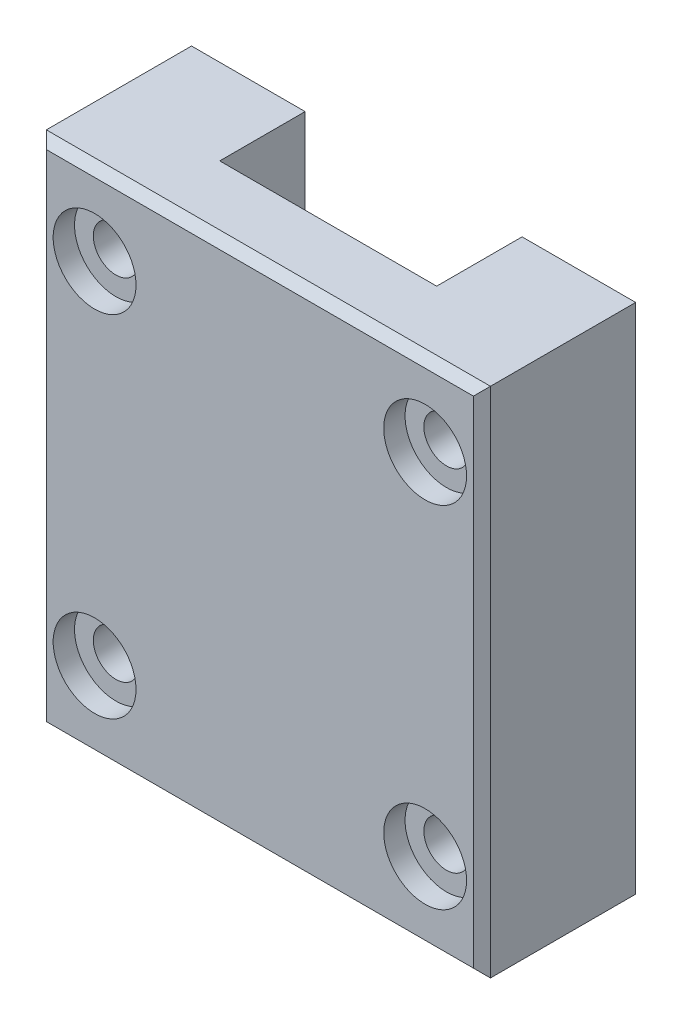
ISO-10303-21;
HEADER;
FILE_DESCRIPTION(('STEP AP214'),'2;1');
FILE_NAME('part.step','',(''),(''),'','','');
FILE_SCHEMA(('AUTOMOTIVE_DESIGN { 1 0 10303 214 1 1 1 1 }'));
ENDSEC;
DATA;
#1=APPLICATION_CONTEXT('core data for automotive mechanical design processes');
#2=APPLICATION_PROTOCOL_DEFINITION('international standard','automotive_design',2000,#1);
#3=PRODUCT_CONTEXT('',#1,'mechanical');
#4=PRODUCT('Part','Part','',(#3));
#5=PRODUCT_RELATED_PRODUCT_CATEGORY('part','',(#4));
#6=PRODUCT_DEFINITION_FORMATION('','',#4);
#7=PRODUCT_DEFINITION_CONTEXT('part definition',#1,'design');
#8=PRODUCT_DEFINITION('design','',#6,#7);
#9=PRODUCT_DEFINITION_SHAPE('','',#8);
#10=(LENGTH_UNIT() NAMED_UNIT(*) SI_UNIT(.MILLI.,.METRE.));
#11=(NAMED_UNIT(*) PLANE_ANGLE_UNIT() SI_UNIT($,.RADIAN.));
#12=(NAMED_UNIT(*) SI_UNIT($,.STERADIAN.) SOLID_ANGLE_UNIT());
#13=UNCERTAINTY_MEASURE_WITH_UNIT(LENGTH_MEASURE(1.E-05),#10,'distance_accuracy_value','');
#14=(GEOMETRIC_REPRESENTATION_CONTEXT(3) GLOBAL_UNCERTAINTY_ASSIGNED_CONTEXT((#13)) GLOBAL_UNIT_ASSIGNED_CONTEXT((#10,
#11,#12)) REPRESENTATION_CONTEXT('',''));
#15=CARTESIAN_POINT('',(0.,0.,0.));
#16=DIRECTION('',(0.,0.,1.));
#17=DIRECTION('',(1.,0.,0.));
#18=AXIS2_PLACEMENT_3D('',#15,#16,#17);
#19=CARTESIAN_POINT('',(-9.95000000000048,99.4999999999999,-10.));
#20=DIRECTION('',(0.,0.,1.));
#21=DIRECTION('',(1.,0.,0.));
#22=AXIS2_PLACEMENT_3D('',#19,#20,#21);
#23=CYLINDRICAL_SURFACE('',#22,2.65);
#24=CARTESIAN_POINT('',(-9.95000000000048,99.4999999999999,-10.));
#25=DIRECTION('',(0.,0.,1.));
#26=DIRECTION('',(1.,0.,0.));
#27=AXIS2_PLACEMENT_3D('',#24,#25,#26);
#28=CIRCLE('',#27,2.65);
#29=CARTESIAN_POINT('',(-7.30000000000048,99.4999999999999,-10.));
#30=VERTEX_POINT('',#29);
#31=EDGE_CURVE('E316',#30,#30,#28,.T.);
#32=ORIENTED_EDGE('',*,*,#31,.F.);
#33=EDGE_LOOP('',(#32));
#34=FACE_BOUND('',#33,.T.);
#35=CARTESIAN_POINT('',(-9.95000000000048,99.4999999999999,5.5));
#36=DIRECTION('',(0.,0.,1.));
#37=DIRECTION('',(1.,0.,0.));
#38=AXIS2_PLACEMENT_3D('',#35,#36,#37);
#39=CIRCLE('',#38,2.65);
#40=CARTESIAN_POINT('',(-7.30000000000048,99.4999999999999,5.5));
#41=VERTEX_POINT('',#40);
#42=EDGE_CURVE('E40',#41,#41,#39,.F.);
#43=ORIENTED_EDGE('',*,*,#42,.F.);
#44=EDGE_LOOP('',(#43));
#45=FACE_BOUND('',#44,.T.);
#46=ADVANCED_FACE('F35',(#34,#45),#23,.F.);
#47=CARTESIAN_POINT('',(-9.95000000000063,140.5,-10.));
#48=DIRECTION('',(0.,0.,1.));
#49=DIRECTION('',(1.,0.,0.));
#50=AXIS2_PLACEMENT_3D('',#47,#48,#49);
#51=CYLINDRICAL_SURFACE('',#50,2.65);
#52=CARTESIAN_POINT('',(-9.95000000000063,140.5,-10.));
#53=DIRECTION('',(0.,0.,1.));
#54=DIRECTION('',(1.,0.,0.));
#55=AXIS2_PLACEMENT_3D('',#52,#53,#54);
#56=CIRCLE('',#55,2.65);
#57=CARTESIAN_POINT('',(-7.30000000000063,140.5,-10.));
#58=VERTEX_POINT('',#57);
#59=EDGE_CURVE('E319',#58,#58,#56,.T.);
#60=ORIENTED_EDGE('',*,*,#59,.F.);
#61=EDGE_LOOP('',(#60));
#62=FACE_BOUND('',#61,.T.);
#63=CARTESIAN_POINT('',(-9.95000000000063,140.5,5.5));
#64=DIRECTION('',(0.,0.,1.));
#65=DIRECTION('',(1.,0.,0.));
#66=AXIS2_PLACEMENT_3D('',#63,#64,#65);
#67=CIRCLE('',#66,2.65);
#68=CARTESIAN_POINT('',(-7.30000000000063,140.5,5.5));
#69=VERTEX_POINT('',#68);
#70=EDGE_CURVE('E189',#69,#69,#67,.F.);
#71=ORIENTED_EDGE('',*,*,#70,.F.);
#72=EDGE_LOOP('',(#71));
#73=FACE_BOUND('',#72,.T.);
#74=ADVANCED_FACE('F199',(#62,#73),#51,.F.);
#75=CARTESIAN_POINT('',(-48.6500000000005,99.4999999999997,-10.));
#76=DIRECTION('',(0.,0.,1.));
#77=DIRECTION('',(1.,0.,0.));
#78=AXIS2_PLACEMENT_3D('',#75,#76,#77);
#79=CYLINDRICAL_SURFACE('',#78,2.65);
#80=CARTESIAN_POINT('',(-48.6500000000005,99.4999999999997,-10.));
#81=DIRECTION('',(0.,0.,1.));
#82=DIRECTION('',(1.,0.,0.));
#83=AXIS2_PLACEMENT_3D('',#80,#81,#82);
#84=CIRCLE('',#83,2.65);
#85=CARTESIAN_POINT('',(-46.0000000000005,99.4999999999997,-10.));
#86=VERTEX_POINT('',#85);
#87=EDGE_CURVE('E124',#86,#86,#84,.T.);
#88=ORIENTED_EDGE('',*,*,#87,.F.);
#89=EDGE_LOOP('',(#88));
#90=FACE_BOUND('',#89,.T.);
#91=CARTESIAN_POINT('',(-48.6500000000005,99.4999999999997,5.5));
#92=DIRECTION('',(0.,0.,1.));
#93=DIRECTION('',(1.,0.,0.));
#94=AXIS2_PLACEMENT_3D('',#91,#92,#93);
#95=CIRCLE('',#94,2.65);
#96=CARTESIAN_POINT('',(-46.0000000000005,99.4999999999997,5.5));
#97=VERTEX_POINT('',#96);
#98=EDGE_CURVE('E186',#97,#97,#95,.F.);
#99=ORIENTED_EDGE('',*,*,#98,.F.);
#100=EDGE_LOOP('',(#99));
#101=FACE_BOUND('',#100,.T.);
#102=ADVANCED_FACE('F205',(#90,#101),#79,.F.);
#103=CARTESIAN_POINT('',(-48.6500000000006,140.5,-10.));
#104=DIRECTION('',(0.,0.,1.));
#105=DIRECTION('',(1.,0.,0.));
#106=AXIS2_PLACEMENT_3D('',#103,#104,#105);
#107=CYLINDRICAL_SURFACE('',#106,2.65);
#108=CARTESIAN_POINT('',(-48.6500000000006,140.5,-10.));
#109=DIRECTION('',(0.,0.,1.));
#110=DIRECTION('',(1.,0.,0.));
#111=AXIS2_PLACEMENT_3D('',#108,#109,#110);
#112=CIRCLE('',#111,2.65);
#113=CARTESIAN_POINT('',(-46.0000000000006,140.5,-10.));
#114=VERTEX_POINT('',#113);
#115=EDGE_CURVE('E182',#114,#114,#112,.T.);
#116=ORIENTED_EDGE('',*,*,#115,.F.);
#117=EDGE_LOOP('',(#116));
#118=FACE_BOUND('',#117,.T.);
#119=CARTESIAN_POINT('',(-48.6500000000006,140.5,5.5));
#120=DIRECTION('',(0.,0.,1.));
#121=DIRECTION('',(1.,0.,0.));
#122=AXIS2_PLACEMENT_3D('',#119,#120,#121);
#123=CIRCLE('',#122,2.65);
#124=CARTESIAN_POINT('',(-46.0000000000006,140.5,5.5));
#125=VERTEX_POINT('',#124);
#126=EDGE_CURVE('E183',#125,#125,#123,.F.);
#127=ORIENTED_EDGE('',*,*,#126,.F.);
#128=EDGE_LOOP('',(#127));
#129=FACE_BOUND('',#128,.T.);
#130=ADVANCED_FACE('F213',(#118,#129),#107,.F.);
#131=CARTESIAN_POINT('',(0.,0.,0.));
#132=DIRECTION('',(0.,0.,1.));
#133=DIRECTION('',(1.,0.,0.));
#134=AXIS2_PLACEMENT_3D('',#131,#132,#133);
#135=PLANE('',#134);
#136=DIRECTION('',(-1.,0.,0.));
#137=VECTOR('',#136,1.);
#138=CARTESIAN_POINT('',(-42.,150.,0.));
#139=LINE('',#138,#137);
#140=CARTESIAN_POINT('',(-16.6000000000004,150.,0.));
#141=VERTEX_POINT('',#140);
#142=CARTESIAN_POINT('',(-42.,150.,0.));
#143=VERTEX_POINT('',#142);
#144=EDGE_CURVE('E132',#141,#143,#139,.T.);
#145=ORIENTED_EDGE('',*,*,#144,.F.);
#146=DIRECTION('',(0.,-1.,0.));
#147=VECTOR('',#146,1.);
#148=CARTESIAN_POINT('',(-16.6000000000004,150.,0.));
#149=LINE('',#148,#147);
#150=CARTESIAN_POINT('',(-16.6000000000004,89.9999999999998,0.));
#151=VERTEX_POINT('',#150);
#152=EDGE_CURVE('E116',#141,#151,#149,.T.);
#153=ORIENTED_EDGE('',*,*,#152,.T.);
#154=DIRECTION('',(1.,0.,0.));
#155=VECTOR('',#154,1.);
#156=CARTESIAN_POINT('',(-16.6000000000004,89.9999999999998,0.));
#157=LINE('',#156,#155);
#158=CARTESIAN_POINT('',(-42.,89.9999999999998,0.));
#159=VERTEX_POINT('',#158);
#160=EDGE_CURVE('E130',#159,#151,#157,.T.);
#161=ORIENTED_EDGE('',*,*,#160,.F.);
#162=DIRECTION('',(0.,-1.,0.));
#163=VECTOR('',#162,1.);
#164=CARTESIAN_POINT('',(-42.,150.,0.));
#165=LINE('',#164,#163);
#166=EDGE_CURVE('E133',#143,#159,#165,.T.);
#167=ORIENTED_EDGE('',*,*,#166,.F.);
#168=EDGE_LOOP('',(#145,#153,#161,#167));
#169=FACE_BOUND('',#168,.T.);
#170=ADVANCED_FACE('F128',(#169),#135,.F.);
#171=CARTESIAN_POINT('',(-55.3000000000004,89.9999999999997,8.));
#172=DIRECTION('',(1.,0.,0.));
#173=DIRECTION('',(0.,0.,-1.));
#174=AXIS2_PLACEMENT_3D('',#171,#172,#173);
#175=PLANE('',#174);
#176=DIRECTION('',(0.,0.,-1.));
#177=VECTOR('',#176,1.);
#178=CARTESIAN_POINT('',(-55.3000000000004,89.9999999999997,8.));
#179=LINE('',#178,#177);
#180=CARTESIAN_POINT('',(-55.3000000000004,89.9999999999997,7.));
#181=VERTEX_POINT('',#180);
#182=CARTESIAN_POINT('',(-55.3000000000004,89.9999999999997,-10.));
#183=VERTEX_POINT('',#182);
#184=EDGE_CURVE('E153',#181,#183,#179,.T.);
#185=ORIENTED_EDGE('',*,*,#184,.F.);
#186=DIRECTION('',(0.,1.,0.));
#187=VECTOR('',#186,1.);
#188=CARTESIAN_POINT('',(-55.3000000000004,150.,7.));
#189=LINE('',#188,#187);
#190=CARTESIAN_POINT('',(-55.3000000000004,150.,7.));
#191=VERTEX_POINT('',#190);
#192=EDGE_CURVE('E11',#181,#191,#189,.T.);
#193=ORIENTED_EDGE('',*,*,#192,.T.);
#194=DIRECTION('',(0.,0.,-1.));
#195=VECTOR('',#194,1.);
#196=CARTESIAN_POINT('',(-55.3000000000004,150.,8.));
#197=LINE('',#196,#195);
#198=CARTESIAN_POINT('',(-55.3000000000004,150.,-10.));
#199=VERTEX_POINT('',#198);
#200=EDGE_CURVE('E155',#191,#199,#197,.T.);
#201=ORIENTED_EDGE('',*,*,#200,.T.);
#202=DIRECTION('',(0.,1.,0.));
#203=VECTOR('',#202,1.);
#204=CARTESIAN_POINT('',(-55.3000000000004,89.9999999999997,-10.));
#205=LINE('',#204,#203);
#206=EDGE_CURVE('E306',#183,#199,#205,.T.);
#207=ORIENTED_EDGE('',*,*,#206,.F.);
#208=EDGE_LOOP('',(#185,#193,#201,#207));
#209=FACE_BOUND('',#208,.T.);
#210=ADVANCED_FACE('F241',(#209),#175,.F.);
#211=CARTESIAN_POINT('',(-16.6000000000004,89.9999999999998,8.));
#212=DIRECTION('',(0.,1.,0.));
#213=DIRECTION('',(-1.,0.,0.));
#214=AXIS2_PLACEMENT_3D('',#211,#212,#213);
#215=PLANE('',#214);
#216=DIRECTION('',(0.,0.,-1.));
#217=VECTOR('',#216,1.);
#218=CARTESIAN_POINT('',(-3.30000000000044,89.9999999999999,8.));
#219=LINE('',#218,#217);
#220=CARTESIAN_POINT('',(-3.30000000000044,89.9999999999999,7.));
#221=VERTEX_POINT('',#220);
#222=CARTESIAN_POINT('',(-3.30000000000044,89.9999999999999,-10.));
#223=VERTEX_POINT('',#222);
#224=EDGE_CURVE('E151',#221,#223,#219,.T.);
#225=ORIENTED_EDGE('',*,*,#224,.F.);
#226=DIRECTION('',(-1.,0.,0.));
#227=VECTOR('',#226,1.);
#228=CARTESIAN_POINT('',(-55.3000000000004,89.9999999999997,7.));
#229=LINE('',#228,#227);
#230=EDGE_CURVE('E166',#221,#181,#229,.T.);
#231=ORIENTED_EDGE('',*,*,#230,.T.);
#232=ORIENTED_EDGE('',*,*,#184,.T.);
#233=DIRECTION('',(-1.,0.,0.));
#234=VECTOR('',#233,1.);
#235=CARTESIAN_POINT('',(-42.,89.9999999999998,-10.));
#236=LINE('',#235,#234);
#237=CARTESIAN_POINT('',(-42.,89.9999999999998,-10.));
#238=VERTEX_POINT('',#237);
#239=EDGE_CURVE('E303',#238,#183,#236,.T.);
#240=ORIENTED_EDGE('',*,*,#239,.F.);
#241=DIRECTION('',(0.,0.,1.));
#242=VECTOR('',#241,1.);
#243=CARTESIAN_POINT('',(-42.,89.9999999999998,-10.));
#244=LINE('',#243,#242);
#245=EDGE_CURVE('E141',#238,#159,#244,.T.);
#246=ORIENTED_EDGE('',*,*,#245,.T.);
#247=ORIENTED_EDGE('',*,*,#160,.T.);
#248=DIRECTION('',(0.,0.,1.));
#249=VECTOR('',#248,1.);
#250=CARTESIAN_POINT('',(-16.6000000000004,89.9999999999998,-10.));
#251=LINE('',#250,#249);
#252=CARTESIAN_POINT('',(-16.6000000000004,89.9999999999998,-10.));
#253=VERTEX_POINT('',#252);
#254=EDGE_CURVE('E113',#253,#151,#251,.T.);
#255=ORIENTED_EDGE('',*,*,#254,.F.);
#256=DIRECTION('',(-1.,0.,0.));
#257=VECTOR('',#256,1.);
#258=CARTESIAN_POINT('',(-3.30000000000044,89.9999999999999,-10.));
#259=LINE('',#258,#257);
#260=EDGE_CURVE('E287',#223,#253,#259,.T.);
#261=ORIENTED_EDGE('',*,*,#260,.F.);
#262=EDGE_LOOP('',(#225,#231,#232,#240,#246,#247,#255,#261));
#263=FACE_BOUND('',#262,.T.);
#264=ADVANCED_FACE('F138',(#263),#215,.F.);
#265=CARTESIAN_POINT('',(-3.30000000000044,89.9999999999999,8.));
#266=DIRECTION('',(-1.,0.,0.));
#267=DIRECTION('',(0.,0.,1.));
#268=AXIS2_PLACEMENT_3D('',#265,#266,#267);
#269=PLANE('',#268);
#270=DIRECTION('',(0.,0.,-1.));
#271=VECTOR('',#270,1.);
#272=CARTESIAN_POINT('',(-3.30000000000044,150.,8.));
#273=LINE('',#272,#271);
#274=CARTESIAN_POINT('',(-3.30000000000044,150.,7.));
#275=VERTEX_POINT('',#274);
#276=CARTESIAN_POINT('',(-3.30000000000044,150.,-10.));
#277=VERTEX_POINT('',#276);
#278=EDGE_CURVE('E144',#275,#277,#273,.T.);
#279=ORIENTED_EDGE('',*,*,#278,.F.);
#280=DIRECTION('',(0.,-1.,0.));
#281=VECTOR('',#280,1.);
#282=CARTESIAN_POINT('',(-3.30000000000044,89.9999999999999,7.));
#283=LINE('',#282,#281);
#284=EDGE_CURVE('E169',#275,#221,#283,.T.);
#285=ORIENTED_EDGE('',*,*,#284,.T.);
#286=ORIENTED_EDGE('',*,*,#224,.T.);
#287=DIRECTION('',(0.,-1.,0.));
#288=VECTOR('',#287,1.);
#289=CARTESIAN_POINT('',(-3.30000000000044,150.,-10.));
#290=LINE('',#289,#288);
#291=EDGE_CURVE('E291',#277,#223,#290,.T.);
#292=ORIENTED_EDGE('',*,*,#291,.F.);
#293=EDGE_LOOP('',(#279,#285,#286,#292));
#294=FACE_BOUND('',#293,.T.);
#295=ADVANCED_FACE('F244',(#294),#269,.F.);
#296=CARTESIAN_POINT('',(-42.,150.,8.));
#297=DIRECTION('',(0.,-1.,0.));
#298=DIRECTION('',(0.,0.,-1.));
#299=AXIS2_PLACEMENT_3D('',#296,#297,#298);
#300=PLANE('',#299);
#301=ORIENTED_EDGE('',*,*,#200,.F.);
#302=DIRECTION('',(1.,0.,0.));
#303=VECTOR('',#302,1.);
#304=CARTESIAN_POINT('',(-3.30000000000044,150.,7.));
#305=LINE('',#304,#303);
#306=EDGE_CURVE('E45',#191,#275,#305,.T.);
#307=ORIENTED_EDGE('',*,*,#306,.T.);
#308=ORIENTED_EDGE('',*,*,#278,.T.);
#309=DIRECTION('',(1.,0.,0.));
#310=VECTOR('',#309,1.);
#311=CARTESIAN_POINT('',(-16.6000000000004,150.,-10.));
#312=LINE('',#311,#310);
#313=CARTESIAN_POINT('',(-16.6000000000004,150.,-10.));
#314=VERTEX_POINT('',#313);
#315=EDGE_CURVE('E134',#314,#277,#312,.T.);
#316=ORIENTED_EDGE('',*,*,#315,.F.);
#317=DIRECTION('',(0.,0.,1.));
#318=VECTOR('',#317,1.);
#319=CARTESIAN_POINT('',(-16.6000000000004,150.,-10.));
#320=LINE('',#319,#318);
#321=EDGE_CURVE('E123',#314,#141,#320,.T.);
#322=ORIENTED_EDGE('',*,*,#321,.T.);
#323=ORIENTED_EDGE('',*,*,#144,.T.);
#324=DIRECTION('',(0.,0.,1.));
#325=VECTOR('',#324,1.);
#326=CARTESIAN_POINT('',(-42.,150.,-10.));
#327=LINE('',#326,#325);
#328=CARTESIAN_POINT('',(-42.,150.,-10.));
#329=VERTEX_POINT('',#328);
#330=EDGE_CURVE('E142',#329,#143,#327,.T.);
#331=ORIENTED_EDGE('',*,*,#330,.F.);
#332=DIRECTION('',(1.,0.,0.));
#333=VECTOR('',#332,1.);
#334=CARTESIAN_POINT('',(-55.3000000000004,150.,-10.));
#335=LINE('',#334,#333);
#336=EDGE_CURVE('E298',#199,#329,#335,.T.);
#337=ORIENTED_EDGE('',*,*,#336,.F.);
#338=EDGE_LOOP('',(#301,#307,#308,#316,#322,#323,#331,#337));
#339=FACE_BOUND('',#338,.T.);
#340=ADVANCED_FACE('F237',(#339),#300,.F.);
#341=CARTESIAN_POINT('',(0.,0.,8.));
#342=DIRECTION('',(0.,0.,1.));
#343=DIRECTION('',(1.,0.,0.));
#344=AXIS2_PLACEMENT_3D('',#341,#342,#343);
#345=PLANE('',#344);
#346=CARTESIAN_POINT('',(-9.95000000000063,140.5,8.));
#347=DIRECTION('',(0.,0.,1.));
#348=DIRECTION('',(1.,0.,0.));
#349=AXIS2_PLACEMENT_3D('',#346,#347,#348);
#350=CIRCLE('',#349,4.85);
#351=CARTESIAN_POINT('',(-5.10000000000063,140.5,8.));
#352=VERTEX_POINT('',#351);
#353=EDGE_CURVE('E330',#352,#352,#350,.T.);
#354=ORIENTED_EDGE('',*,*,#353,.F.);
#355=EDGE_LOOP('',(#354));
#356=FACE_BOUND('',#355,.T.);
#357=CARTESIAN_POINT('',(-9.95000000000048,99.4999999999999,8.));
#358=DIRECTION('',(0.,0.,1.));
#359=DIRECTION('',(1.,0.,0.));
#360=AXIS2_PLACEMENT_3D('',#357,#358,#359);
#361=CIRCLE('',#360,4.85);
#362=CARTESIAN_POINT('',(-5.10000000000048,99.4999999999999,8.));
#363=VERTEX_POINT('',#362);
#364=EDGE_CURVE('E336',#363,#363,#361,.T.);
#365=ORIENTED_EDGE('',*,*,#364,.F.);
#366=EDGE_LOOP('',(#365));
#367=FACE_BOUND('',#366,.T.);
#368=CARTESIAN_POINT('',(-48.6500000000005,99.4999999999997,8.));
#369=DIRECTION('',(0.,0.,1.));
#370=DIRECTION('',(1.,0.,0.));
#371=AXIS2_PLACEMENT_3D('',#368,#369,#370);
#372=CIRCLE('',#371,4.85);
#373=CARTESIAN_POINT('',(-43.8000000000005,99.4999999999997,8.));
#374=VERTEX_POINT('',#373);
#375=EDGE_CURVE('E342',#374,#374,#372,.T.);
#376=ORIENTED_EDGE('',*,*,#375,.F.);
#377=EDGE_LOOP('',(#376));
#378=FACE_BOUND('',#377,.T.);
#379=CARTESIAN_POINT('',(-48.6500000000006,140.5,8.));
#380=DIRECTION('',(0.,0.,1.));
#381=DIRECTION('',(1.,0.,0.));
#382=AXIS2_PLACEMENT_3D('',#379,#380,#381);
#383=CIRCLE('',#382,4.85);
#384=CARTESIAN_POINT('',(-43.8000000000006,140.5,8.));
#385=VERTEX_POINT('',#384);
#386=EDGE_CURVE('E324',#385,#385,#383,.T.);
#387=ORIENTED_EDGE('',*,*,#386,.F.);
#388=EDGE_LOOP('',(#387));
#389=FACE_BOUND('',#388,.T.);
#390=DIRECTION('',(0.,-1.,0.));
#391=VECTOR('',#390,1.);
#392=CARTESIAN_POINT('',(-54.3000000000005,89.9999999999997,8.));
#393=LINE('',#392,#391);
#394=CARTESIAN_POINT('',(-54.3000000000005,149.,8.));
#395=VERTEX_POINT('',#394);
#396=CARTESIAN_POINT('',(-54.3000000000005,90.9999999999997,8.));
#397=VERTEX_POINT('',#396);
#398=EDGE_CURVE('E157',#395,#397,#393,.T.);
#399=ORIENTED_EDGE('',*,*,#398,.T.);
#400=DIRECTION('',(1.,0.,0.));
#401=VECTOR('',#400,1.);
#402=CARTESIAN_POINT('',(-3.30000000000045,90.9999999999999,8.));
#403=LINE('',#402,#401);
#404=CARTESIAN_POINT('',(-4.30000000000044,90.9999999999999,8.));
#405=VERTEX_POINT('',#404);
#406=EDGE_CURVE('E163',#397,#405,#403,.T.);
#407=ORIENTED_EDGE('',*,*,#406,.T.);
#408=DIRECTION('',(0.,1.,0.));
#409=VECTOR('',#408,1.);
#410=CARTESIAN_POINT('',(-4.30000000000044,150.,8.));
#411=LINE('',#410,#409);
#412=CARTESIAN_POINT('',(-4.30000000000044,149.,8.));
#413=VERTEX_POINT('',#412);
#414=EDGE_CURVE('E161',#405,#413,#411,.T.);
#415=ORIENTED_EDGE('',*,*,#414,.T.);
#416=DIRECTION('',(-1.,0.,0.));
#417=VECTOR('',#416,1.);
#418=CARTESIAN_POINT('',(-55.3000000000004,149.,8.));
#419=LINE('',#418,#417);
#420=EDGE_CURVE('E159',#413,#395,#419,.T.);
#421=ORIENTED_EDGE('',*,*,#420,.T.);
#422=EDGE_LOOP('',(#399,#407,#415,#421));
#423=FACE_BOUND('',#422,.T.);
#424=ADVANCED_FACE('F233',(#356,#367,#378,#389,#423),#345,.T.);
#425=CARTESIAN_POINT('',(-42.,150.,-10.));
#426=DIRECTION('',(-1.,0.,0.));
#427=DIRECTION('',(0.,0.,1.));
#428=AXIS2_PLACEMENT_3D('',#425,#426,#427);
#429=PLANE('',#428);
#430=ORIENTED_EDGE('',*,*,#166,.T.);
#431=ORIENTED_EDGE('',*,*,#245,.F.);
#432=DIRECTION('',(0.,-1.,0.));
#433=VECTOR('',#432,1.);
#434=CARTESIAN_POINT('',(-42.,150.,-10.));
#435=LINE('',#434,#433);
#436=EDGE_CURVE('E301',#329,#238,#435,.T.);
#437=ORIENTED_EDGE('',*,*,#436,.F.);
#438=ORIENTED_EDGE('',*,*,#330,.T.);
#439=EDGE_LOOP('',(#430,#431,#437,#438));
#440=FACE_BOUND('',#439,.T.);
#441=ADVANCED_FACE('F229',(#440),#429,.F.);
#442=CARTESIAN_POINT('',(0.,0.,-10.));
#443=DIRECTION('',(0.,0.,-1.));
#444=DIRECTION('',(-1.,0.,0.));
#445=AXIS2_PLACEMENT_3D('',#442,#443,#444);
#446=PLANE('',#445);
#447=ORIENTED_EDGE('',*,*,#115,.T.);
#448=EDGE_LOOP('',(#447));
#449=FACE_BOUND('',#448,.T.);
#450=ORIENTED_EDGE('',*,*,#87,.T.);
#451=EDGE_LOOP('',(#450));
#452=FACE_BOUND('',#451,.T.);
#453=ORIENTED_EDGE('',*,*,#336,.T.);
#454=ORIENTED_EDGE('',*,*,#436,.T.);
#455=ORIENTED_EDGE('',*,*,#239,.T.);
#456=ORIENTED_EDGE('',*,*,#206,.T.);
#457=EDGE_LOOP('',(#453,#454,#455,#456));
#458=FACE_BOUND('',#457,.T.);
#459=ADVANCED_FACE('F223',(#449,#452,#458),#446,.T.);
#460=CARTESIAN_POINT('',(-16.6000000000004,150.,-10.));
#461=DIRECTION('',(-1.,0.,0.));
#462=DIRECTION('',(0.,0.,1.));
#463=AXIS2_PLACEMENT_3D('',#460,#461,#462);
#464=PLANE('',#463);
#465=ORIENTED_EDGE('',*,*,#152,.F.);
#466=ORIENTED_EDGE('',*,*,#321,.F.);
#467=DIRECTION('',(0.,-1.,0.));
#468=VECTOR('',#467,1.);
#469=CARTESIAN_POINT('',(-16.6000000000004,150.,-10.));
#470=LINE('',#469,#468);
#471=EDGE_CURVE('E119',#314,#253,#470,.T.);
#472=ORIENTED_EDGE('',*,*,#471,.T.);
#473=ORIENTED_EDGE('',*,*,#254,.T.);
#474=EDGE_LOOP('',(#465,#466,#472,#473));
#475=FACE_BOUND('',#474,.T.);
#476=ADVANCED_FACE('F115',(#475),#464,.T.);
#477=CARTESIAN_POINT('',(0.,0.,-10.));
#478=DIRECTION('',(0.,0.,-1.));
#479=DIRECTION('',(-1.,0.,0.));
#480=AXIS2_PLACEMENT_3D('',#477,#478,#479);
#481=PLANE('',#480);
#482=ORIENTED_EDGE('',*,*,#59,.T.);
#483=EDGE_LOOP('',(#482));
#484=FACE_BOUND('',#483,.T.);
#485=ORIENTED_EDGE('',*,*,#31,.T.);
#486=EDGE_LOOP('',(#485));
#487=FACE_BOUND('',#486,.T.);
#488=ORIENTED_EDGE('',*,*,#315,.T.);
#489=ORIENTED_EDGE('',*,*,#291,.T.);
#490=ORIENTED_EDGE('',*,*,#260,.T.);
#491=ORIENTED_EDGE('',*,*,#471,.F.);
#492=EDGE_LOOP('',(#488,#489,#490,#491));
#493=FACE_BOUND('',#492,.T.);
#494=ADVANCED_FACE('F222',(#484,#487,#493),#481,.T.);
#495=CARTESIAN_POINT('',(0.,149.,8.));
#496=DIRECTION('',(0.,0.707106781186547,0.707106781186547));
#497=DIRECTION('',(1.,0.,0.));
#498=AXIS2_PLACEMENT_3D('',#495,#496,#497);
#499=PLANE('',#498);
#500=DIRECTION('',(0.577350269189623,0.577350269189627,-0.577350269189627));
#501=VECTOR('',#500,1.);
#502=CARTESIAN_POINT('',(-2.86666666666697,150.433333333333,6.56666666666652));
#503=LINE('',#502,#501);
#504=EDGE_CURVE('E176',#275,#413,#503,.F.);
#505=ORIENTED_EDGE('',*,*,#504,.F.);
#506=ORIENTED_EDGE('',*,*,#306,.F.);
#507=DIRECTION('',(-0.577350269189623,0.577350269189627,-0.577350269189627));
#508=VECTOR('',#507,1.);
#509=CARTESIAN_POINT('',(-4.63333333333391,99.3333333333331,57.6666666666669));
#510=LINE('',#509,#508);
#511=EDGE_CURVE('E179',#395,#191,#510,.T.);
#512=ORIENTED_EDGE('',*,*,#511,.F.);
#513=ORIENTED_EDGE('',*,*,#420,.F.);
#514=EDGE_LOOP('',(#505,#506,#512,#513));
#515=FACE_BOUND('',#514,.T.);
#516=ADVANCED_FACE('F38',(#515),#499,.T.);
#517=CARTESIAN_POINT('',(-54.3000000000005,0.,8.));
#518=DIRECTION('',(-0.70710678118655,0.,0.707106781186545));
#519=DIRECTION('',(0.,1.,0.));
#520=AXIS2_PLACEMENT_3D('',#517,#518,#519);
#521=PLANE('',#520);
#522=ORIENTED_EDGE('',*,*,#511,.T.);
#523=ORIENTED_EDGE('',*,*,#192,.F.);
#524=DIRECTION('',(0.577350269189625,0.577350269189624,0.577350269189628));
#525=VECTOR('',#524,1.);
#526=CARTESIAN_POINT('',(-84.6333333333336,60.6666666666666,-22.3333333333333));
#527=LINE('',#526,#525);
#528=EDGE_CURVE('E174',#397,#181,#527,.F.);
#529=ORIENTED_EDGE('',*,*,#528,.F.);
#530=ORIENTED_EDGE('',*,*,#398,.F.);
#531=EDGE_LOOP('',(#522,#523,#529,#530));
#532=FACE_BOUND('',#531,.T.);
#533=ADVANCED_FACE('F266',(#532),#521,.T.);
#534=CARTESIAN_POINT('',(-4.30000000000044,0.,8.));
#535=DIRECTION('',(0.70710678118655,0.,0.707106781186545));
#536=DIRECTION('',(0.,-1.,0.));
#537=AXIS2_PLACEMENT_3D('',#534,#535,#536);
#538=PLANE('',#537);
#539=ORIENTED_EDGE('',*,*,#504,.T.);
#540=ORIENTED_EDGE('',*,*,#414,.F.);
#541=DIRECTION('',(0.577350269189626,-0.577350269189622,-0.57735026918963));
#542=VECTOR('',#541,1.);
#543=CARTESIAN_POINT('',(26.0333333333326,60.666666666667,-22.3333333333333));
#544=LINE('',#543,#542);
#545=EDGE_CURVE('E172',#221,#405,#544,.F.);
#546=ORIENTED_EDGE('',*,*,#545,.F.);
#547=ORIENTED_EDGE('',*,*,#284,.F.);
#548=EDGE_LOOP('',(#539,#540,#546,#547));
#549=FACE_BOUND('',#548,.T.);
#550=ADVANCED_FACE('F260',(#549),#538,.T.);
#551=CARTESIAN_POINT('',(-2.84859855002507E-13,90.9999999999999,8.));
#552=DIRECTION('',(0.,-0.707106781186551,0.707106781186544));
#553=DIRECTION('',(-1.,0.,0.));
#554=AXIS2_PLACEMENT_3D('',#551,#552,#553);
#555=PLANE('',#554);
#556=ORIENTED_EDGE('',*,*,#528,.T.);
#557=ORIENTED_EDGE('',*,*,#230,.F.);
#558=ORIENTED_EDGE('',*,*,#545,.T.);
#559=ORIENTED_EDGE('',*,*,#406,.F.);
#560=EDGE_LOOP('',(#556,#557,#558,#559));
#561=FACE_BOUND('',#560,.T.);
#562=ADVANCED_FACE('F253',(#561),#555,.T.);
#563=CARTESIAN_POINT('',(-48.6500000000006,140.5,5.5));
#564=DIRECTION('',(0.,0.,1.));
#565=DIRECTION('',(1.,0.,0.));
#566=AXIS2_PLACEMENT_3D('',#563,#564,#565);
#567=PLANE('',#566);
#568=CARTESIAN_POINT('',(-48.6500000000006,140.5,5.5));
#569=DIRECTION('',(0.,0.,1.));
#570=DIRECTION('',(1.,0.,0.));
#571=AXIS2_PLACEMENT_3D('',#568,#569,#570);
#572=CIRCLE('',#571,4.85);
#573=CARTESIAN_POINT('',(-43.8000000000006,140.5,5.5));
#574=VERTEX_POINT('',#573);
#575=EDGE_CURVE('E187',#574,#574,#572,.T.);
#576=ORIENTED_EDGE('',*,*,#575,.T.);
#577=EDGE_LOOP('',(#576));
#578=FACE_BOUND('',#577,.T.);
#579=ORIENTED_EDGE('',*,*,#126,.T.);
#580=EDGE_LOOP('',(#579));
#581=FACE_BOUND('',#580,.T.);
#582=ADVANCED_FACE('F259',(#578,#581),#567,.T.);
#583=CARTESIAN_POINT('',(-48.6500000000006,140.5,5.5));
#584=DIRECTION('',(0.,0.,1.));
#585=DIRECTION('',(1.,0.,0.));
#586=AXIS2_PLACEMENT_3D('',#583,#584,#585);
#587=CYLINDRICAL_SURFACE('',#586,4.85);
#588=ORIENTED_EDGE('',*,*,#575,.F.);
#589=EDGE_LOOP('',(#588));
#590=FACE_BOUND('',#589,.T.);
#591=ORIENTED_EDGE('',*,*,#386,.T.);
#592=EDGE_LOOP('',(#591));
#593=FACE_BOUND('',#592,.T.);
#594=ADVANCED_FACE('F210',(#590,#593),#587,.F.);
#595=CARTESIAN_POINT('',(-48.6500000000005,99.4999999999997,5.5));
#596=DIRECTION('',(0.,0.,1.));
#597=DIRECTION('',(1.,0.,0.));
#598=AXIS2_PLACEMENT_3D('',#595,#596,#597);
#599=PLANE('',#598);
#600=CARTESIAN_POINT('',(-48.6500000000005,99.4999999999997,5.5));
#601=DIRECTION('',(0.,0.,1.));
#602=DIRECTION('',(1.,0.,0.));
#603=AXIS2_PLACEMENT_3D('',#600,#601,#602);
#604=CIRCLE('',#603,4.85);
#605=CARTESIAN_POINT('',(-43.8000000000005,99.4999999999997,5.5));
#606=VERTEX_POINT('',#605);
#607=EDGE_CURVE('E327',#606,#606,#604,.T.);
#608=ORIENTED_EDGE('',*,*,#607,.T.);
#609=EDGE_LOOP('',(#608));
#610=FACE_BOUND('',#609,.T.);
#611=ORIENTED_EDGE('',*,*,#98,.T.);
#612=EDGE_LOOP('',(#611));
#613=FACE_BOUND('',#612,.T.);
#614=ADVANCED_FACE('F348',(#610,#613),#599,.T.);
#615=CARTESIAN_POINT('',(-48.6500000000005,99.4999999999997,5.5));
#616=DIRECTION('',(0.,0.,1.));
#617=DIRECTION('',(1.,0.,0.));
#618=AXIS2_PLACEMENT_3D('',#615,#616,#617);
#619=CYLINDRICAL_SURFACE('',#618,4.85);
#620=ORIENTED_EDGE('',*,*,#607,.F.);
#621=EDGE_LOOP('',(#620));
#622=FACE_BOUND('',#621,.T.);
#623=ORIENTED_EDGE('',*,*,#375,.T.);
#624=EDGE_LOOP('',(#623));
#625=FACE_BOUND('',#624,.T.);
#626=ADVANCED_FACE('F351',(#622,#625),#619,.F.);
#627=CARTESIAN_POINT('',(-9.95000000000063,140.5,5.5));
#628=DIRECTION('',(0.,0.,1.));
#629=DIRECTION('',(1.,0.,0.));
#630=AXIS2_PLACEMENT_3D('',#627,#628,#629);
#631=PLANE('',#630);
#632=CARTESIAN_POINT('',(-9.95000000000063,140.5,5.5));
#633=DIRECTION('',(0.,0.,1.));
#634=DIRECTION('',(1.,0.,0.));
#635=AXIS2_PLACEMENT_3D('',#632,#633,#634);
#636=CIRCLE('',#635,4.85);
#637=CARTESIAN_POINT('',(-5.10000000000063,140.5,5.5));
#638=VERTEX_POINT('',#637);
#639=EDGE_CURVE('E333',#638,#638,#636,.T.);
#640=ORIENTED_EDGE('',*,*,#639,.T.);
#641=EDGE_LOOP('',(#640));
#642=FACE_BOUND('',#641,.T.);
#643=ORIENTED_EDGE('',*,*,#70,.T.);
#644=EDGE_LOOP('',(#643));
#645=FACE_BOUND('',#644,.T.);
#646=ADVANCED_FACE('F354',(#642,#645),#631,.T.);
#647=CARTESIAN_POINT('',(-9.95000000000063,140.5,5.5));
#648=DIRECTION('',(0.,0.,1.));
#649=DIRECTION('',(1.,0.,0.));
#650=AXIS2_PLACEMENT_3D('',#647,#648,#649);
#651=CYLINDRICAL_SURFACE('',#650,4.85);
#652=ORIENTED_EDGE('',*,*,#639,.F.);
#653=EDGE_LOOP('',(#652));
#654=FACE_BOUND('',#653,.T.);
#655=ORIENTED_EDGE('',*,*,#353,.T.);
#656=EDGE_LOOP('',(#655));
#657=FACE_BOUND('',#656,.T.);
#658=ADVANCED_FACE('F376',(#654,#657),#651,.F.);
#659=CARTESIAN_POINT('',(-9.95000000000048,99.4999999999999,5.5));
#660=DIRECTION('',(0.,0.,1.));
#661=DIRECTION('',(1.,0.,0.));
#662=AXIS2_PLACEMENT_3D('',#659,#660,#661);
#663=PLANE('',#662);
#664=CARTESIAN_POINT('',(-9.95000000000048,99.4999999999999,5.5));
#665=DIRECTION('',(0.,0.,1.));
#666=DIRECTION('',(1.,0.,0.));
#667=AXIS2_PLACEMENT_3D('',#664,#665,#666);
#668=CIRCLE('',#667,4.85);
#669=CARTESIAN_POINT('',(-5.10000000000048,99.4999999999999,5.5));
#670=VERTEX_POINT('',#669);
#671=EDGE_CURVE('E339',#670,#670,#668,.T.);
#672=ORIENTED_EDGE('',*,*,#671,.T.);
#673=EDGE_LOOP('',(#672));
#674=FACE_BOUND('',#673,.T.);
#675=ORIENTED_EDGE('',*,*,#42,.T.);
#676=EDGE_LOOP('',(#675));
#677=FACE_BOUND('',#676,.T.);
#678=ADVANCED_FACE('F196',(#674,#677),#663,.T.);
#679=CARTESIAN_POINT('',(-9.95000000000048,99.4999999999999,5.5));
#680=DIRECTION('',(0.,0.,1.));
#681=DIRECTION('',(1.,0.,0.));
#682=AXIS2_PLACEMENT_3D('',#679,#680,#681);
#683=CYLINDRICAL_SURFACE('',#682,4.85);
#684=ORIENTED_EDGE('',*,*,#671,.F.);
#685=EDGE_LOOP('',(#684));
#686=FACE_BOUND('',#685,.T.);
#687=ORIENTED_EDGE('',*,*,#364,.T.);
#688=EDGE_LOOP('',(#687));
#689=FACE_BOUND('',#688,.T.);
#690=ADVANCED_FACE('F383',(#686,#689),#683,.F.);
#691=CLOSED_SHELL('',(#46,#74,#102,#130,#170,#210,#264,#295,#340,#424,#441,#459,#476,#494,#516,
#533,#550,#562,#582,#594,#614,#626,#646,#658,#678,#690));
#692=MANIFOLD_SOLID_BREP('B2',#691);
#693=ADVANCED_BREP_SHAPE_REPRESENTATION('',(#18,#692),#14);
#694=SHAPE_DEFINITION_REPRESENTATION(#9,#693);
ENDSEC;
END-ISO-10303-21;
